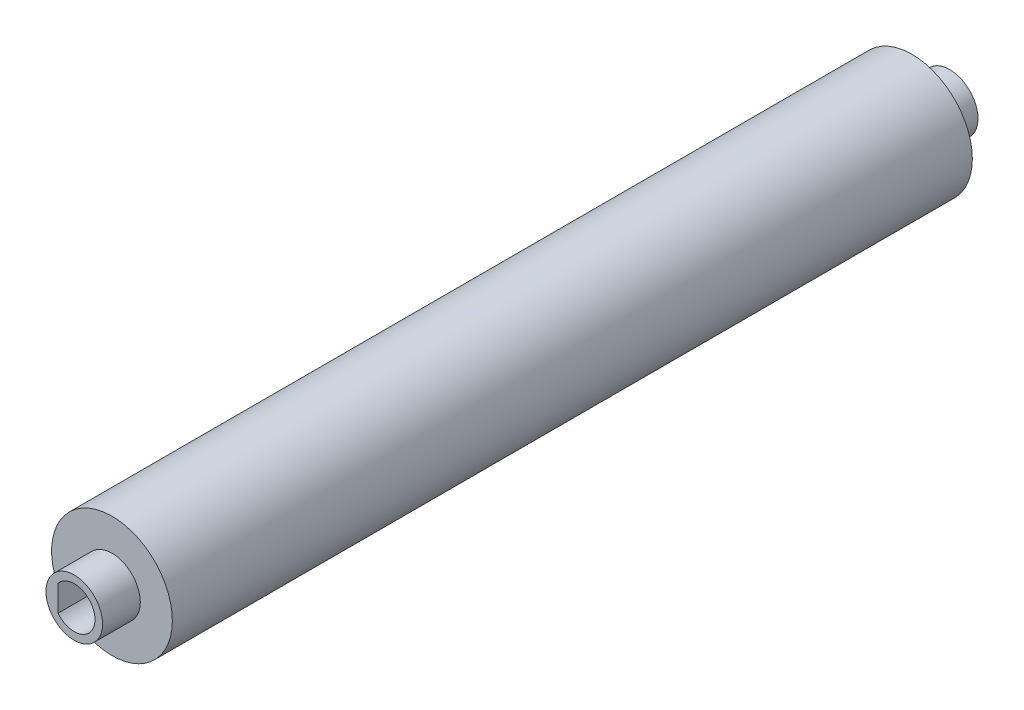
ISO-10303-21;
HEADER;
FILE_DESCRIPTION(('STEP AP214'),'2;1');
FILE_NAME('part.step','',(''),(''),'','','');
FILE_SCHEMA(('AUTOMOTIVE_DESIGN { 1 0 10303 214 1 1 1 1 }'));
ENDSEC;
DATA;
#1=APPLICATION_CONTEXT('core data for automotive mechanical design processes');
#2=APPLICATION_PROTOCOL_DEFINITION('international standard','automotive_design',2000,#1);
#3=PRODUCT_CONTEXT('',#1,'mechanical');
#4=PRODUCT('Part','Part','',(#3));
#5=PRODUCT_RELATED_PRODUCT_CATEGORY('part','',(#4));
#6=PRODUCT_DEFINITION_FORMATION('','',#4);
#7=PRODUCT_DEFINITION_CONTEXT('part definition',#1,'design');
#8=PRODUCT_DEFINITION('design','',#6,#7);
#9=PRODUCT_DEFINITION_SHAPE('','',#8);
#10=(LENGTH_UNIT() NAMED_UNIT(*) SI_UNIT(.MILLI.,.METRE.));
#11=(NAMED_UNIT(*) PLANE_ANGLE_UNIT() SI_UNIT($,.RADIAN.));
#12=(NAMED_UNIT(*) SI_UNIT($,.STERADIAN.) SOLID_ANGLE_UNIT());
#13=UNCERTAINTY_MEASURE_WITH_UNIT(LENGTH_MEASURE(1.E-05),#10,'distance_accuracy_value','');
#14=(GEOMETRIC_REPRESENTATION_CONTEXT(3) GLOBAL_UNCERTAINTY_ASSIGNED_CONTEXT((#13)) GLOBAL_UNIT_ASSIGNED_CONTEXT((#10,
#11,#12)) REPRESENTATION_CONTEXT('',''));
#15=CARTESIAN_POINT('',(0.,0.,0.));
#16=DIRECTION('',(0.,0.,1.));
#17=DIRECTION('',(1.,0.,0.));
#18=AXIS2_PLACEMENT_3D('',#15,#16,#17);
#19=CARTESIAN_POINT('',(0.,0.,106.));
#20=DIRECTION('',(0.,0.,-1.));
#21=DIRECTION('',(-1.,0.,0.));
#22=AXIS2_PLACEMENT_3D('',#19,#20,#21);
#23=CYLINDRICAL_SURFACE('',#22,8.);
#24=CARTESIAN_POINT('',(0.,0.,106.));
#25=DIRECTION('',(0.,0.,1.));
#26=DIRECTION('',(1.,0.,0.));
#27=AXIS2_PLACEMENT_3D('',#24,#25,#26);
#28=CIRCLE('',#27,8.);
#29=CARTESIAN_POINT('',(8.,0.,106.));
#30=VERTEX_POINT('',#29);
#31=EDGE_CURVE('E47',#30,#30,#28,.T.);
#32=ORIENTED_EDGE('',*,*,#31,.F.);
#33=EDGE_LOOP('',(#32));
#34=FACE_BOUND('',#33,.T.);
#35=CARTESIAN_POINT('',(0.,0.,0.));
#36=DIRECTION('',(0.,0.,1.));
#37=DIRECTION('',(1.,0.,0.));
#38=AXIS2_PLACEMENT_3D('',#35,#36,#37);
#39=CIRCLE('',#38,8.);
#40=CARTESIAN_POINT('',(8.,0.,0.));
#41=VERTEX_POINT('',#40);
#42=EDGE_CURVE('E93',#41,#41,#39,.T.);
#43=ORIENTED_EDGE('',*,*,#42,.T.);
#44=EDGE_LOOP('',(#43));
#45=FACE_BOUND('',#44,.T.);
#46=ADVANCED_FACE('F39',(#34,#45),#23,.T.);
#47=CARTESIAN_POINT('',(0.,0.,106.));
#48=DIRECTION('',(0.,0.,1.));
#49=DIRECTION('',(1.,0.,0.));
#50=AXIS2_PLACEMENT_3D('',#47,#48,#49);
#51=PLANE('',#50);
#52=CARTESIAN_POINT('',(0.,0.,106.));
#53=DIRECTION('',(0.,0.,1.));
#54=DIRECTION('',(1.,0.,0.));
#55=AXIS2_PLACEMENT_3D('',#52,#53,#54);
#56=CIRCLE('',#55,3.75);
#57=CARTESIAN_POINT('',(3.75,0.,106.));
#58=VERTEX_POINT('',#57);
#59=EDGE_CURVE('E11',#58,#58,#56,.T.);
#60=ORIENTED_EDGE('',*,*,#59,.F.);
#61=EDGE_LOOP('',(#60));
#62=FACE_BOUND('',#61,.T.);
#63=ORIENTED_EDGE('',*,*,#31,.T.);
#64=EDGE_LOOP('',(#63));
#65=FACE_BOUND('',#64,.T.);
#66=ADVANCED_FACE('F118',(#62,#65),#51,.T.);
#67=CARTESIAN_POINT('',(0.,0.,0.));
#68=DIRECTION('',(0.,0.,1.));
#69=DIRECTION('',(1.,0.,0.));
#70=AXIS2_PLACEMENT_3D('',#67,#68,#69);
#71=PLANE('',#70);
#72=CARTESIAN_POINT('',(0.,0.,0.));
#73=DIRECTION('',(0.,0.,1.));
#74=DIRECTION('',(1.,0.,0.));
#75=AXIS2_PLACEMENT_3D('',#72,#73,#74);
#76=CIRCLE('',#75,3.75);
#77=CARTESIAN_POINT('',(3.75,0.,0.));
#78=VERTEX_POINT('',#77);
#79=EDGE_CURVE('E42',#78,#78,#76,.T.);
#80=ORIENTED_EDGE('',*,*,#79,.T.);
#81=EDGE_LOOP('',(#80));
#82=FACE_BOUND('',#81,.T.);
#83=ORIENTED_EDGE('',*,*,#42,.F.);
#84=EDGE_LOOP('',(#83));
#85=FACE_BOUND('',#84,.T.);
#86=ADVANCED_FACE('F100',(#82,#85),#71,.F.);
#87=CARTESIAN_POINT('',(0.,0.,-5.));
#88=DIRECTION('',(0.,0.,1.));
#89=DIRECTION('',(1.,0.,0.));
#90=AXIS2_PLACEMENT_3D('',#87,#88,#89);
#91=PLANE('',#90);
#92=CARTESIAN_POINT('',(0.,0.,-5.));
#93=DIRECTION('',(0.,0.,1.));
#94=DIRECTION('',(1.,0.,0.));
#95=AXIS2_PLACEMENT_3D('',#92,#93,#94);
#96=CIRCLE('',#95,3.75);
#97=CARTESIAN_POINT('',(3.75,0.,-5.));
#98=VERTEX_POINT('',#97);
#99=EDGE_CURVE('E89',#98,#98,#96,.T.);
#100=ORIENTED_EDGE('',*,*,#99,.F.);
#101=EDGE_LOOP('',(#100));
#102=FACE_BOUND('',#101,.T.);
#103=ADVANCED_FACE('F106',(#102),#91,.F.);
#104=CARTESIAN_POINT('',(0.,0.,-5.));
#105=DIRECTION('',(0.,0.,1.));
#106=DIRECTION('',(1.,0.,0.));
#107=AXIS2_PLACEMENT_3D('',#104,#105,#106);
#108=CYLINDRICAL_SURFACE('',#107,3.75);
#109=ORIENTED_EDGE('',*,*,#99,.T.);
#110=EDGE_LOOP('',(#109));
#111=FACE_BOUND('',#110,.T.);
#112=ORIENTED_EDGE('',*,*,#79,.F.);
#113=EDGE_LOOP('',(#112));
#114=FACE_BOUND('',#113,.T.);
#115=ADVANCED_FACE('F103',(#111,#114),#108,.T.);
#116=ORIENTED_EDGE('',*,*,#59,.T.);
#117=EDGE_LOOP('',(#116));
#118=FACE_BOUND('',#117,.T.);
#119=CARTESIAN_POINT('',(0.,0.,111.));
#120=DIRECTION('',(0.,0.,1.));
#121=DIRECTION('',(1.,0.,0.));
#122=AXIS2_PLACEMENT_3D('',#119,#120,#121);
#123=CIRCLE('',#122,3.75);
#124=CARTESIAN_POINT('',(3.75,0.,111.));
#125=VERTEX_POINT('',#124);
#126=EDGE_CURVE('E71',#125,#125,#123,.T.);
#127=ORIENTED_EDGE('',*,*,#126,.F.);
#128=EDGE_LOOP('',(#127));
#129=FACE_BOUND('',#128,.T.);
#130=ADVANCED_FACE('F105',(#118,#129),#108,.T.);
#131=CARTESIAN_POINT('',(0.,0.,111.));
#132=DIRECTION('',(0.,0.,1.));
#133=DIRECTION('',(1.,0.,0.));
#134=AXIS2_PLACEMENT_3D('',#131,#132,#133);
#135=PLANE('',#134);
#136=CARTESIAN_POINT('',(0.,0.,111.));
#137=DIRECTION('',(0.,0.,1.));
#138=DIRECTION('',(1.,0.,0.));
#139=AXIS2_PLACEMENT_3D('',#136,#137,#138);
#140=CIRCLE('',#139,2.75);
#141=CARTESIAN_POINT('',(-2.15,-1.71464281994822,111.));
#142=VERTEX_POINT('',#141);
#143=CARTESIAN_POINT('',(-2.15,1.71464281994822,111.));
#144=VERTEX_POINT('',#143);
#145=EDGE_CURVE('E55',#142,#144,#140,.T.);
#146=ORIENTED_EDGE('',*,*,#145,.F.);
#147=DIRECTION('',(0.,-1.,0.));
#148=VECTOR('',#147,1.);
#149=CARTESIAN_POINT('',(-2.15,1.71464281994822,111.));
#150=LINE('',#149,#148);
#151=EDGE_CURVE('E75',#144,#142,#150,.T.);
#152=ORIENTED_EDGE('',*,*,#151,.F.);
#153=EDGE_LOOP('',(#146,#152));
#154=FACE_BOUND('',#153,.T.);
#155=ORIENTED_EDGE('',*,*,#126,.T.);
#156=EDGE_LOOP('',(#155));
#157=FACE_BOUND('',#156,.T.);
#158=ADVANCED_FACE('F79',(#154,#157),#135,.T.);
#159=CARTESIAN_POINT('',(0.,0.,90.));
#160=DIRECTION('',(0.,0.,1.));
#161=DIRECTION('',(1.,0.,0.));
#162=AXIS2_PLACEMENT_3D('',#159,#160,#161);
#163=CYLINDRICAL_SURFACE('',#162,2.75);
#164=ORIENTED_EDGE('',*,*,#145,.T.);
#165=DIRECTION('',(0.,0.,1.));
#166=VECTOR('',#165,1.);
#167=CARTESIAN_POINT('',(-2.15,1.71464281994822,90.));
#168=LINE('',#167,#166);
#169=CARTESIAN_POINT('',(-2.15,1.71464281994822,90.));
#170=VERTEX_POINT('',#169);
#171=EDGE_CURVE('E72',#170,#144,#168,.T.);
#172=ORIENTED_EDGE('',*,*,#171,.F.);
#173=CARTESIAN_POINT('',(0.,0.,90.));
#174=DIRECTION('',(0.,0.,1.));
#175=DIRECTION('',(1.,0.,0.));
#176=AXIS2_PLACEMENT_3D('',#173,#174,#175);
#177=CIRCLE('',#176,2.75);
#178=CARTESIAN_POINT('',(-2.15,-1.71464281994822,90.));
#179=VERTEX_POINT('',#178);
#180=EDGE_CURVE('E69',#179,#170,#177,.T.);
#181=ORIENTED_EDGE('',*,*,#180,.F.);
#182=DIRECTION('',(0.,0.,1.));
#183=VECTOR('',#182,1.);
#184=CARTESIAN_POINT('',(-2.15,-1.71464281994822,90.));
#185=LINE('',#184,#183);
#186=EDGE_CURVE('E63',#179,#142,#185,.T.);
#187=ORIENTED_EDGE('',*,*,#186,.T.);
#188=EDGE_LOOP('',(#164,#172,#181,#187));
#189=FACE_BOUND('',#188,.T.);
#190=ADVANCED_FACE('F67',(#189),#163,.F.);
#191=CARTESIAN_POINT('',(-2.15,1.71464281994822,90.));
#192=DIRECTION('',(-1.,0.,0.));
#193=DIRECTION('',(0.,0.,1.));
#194=AXIS2_PLACEMENT_3D('',#191,#192,#193);
#195=PLANE('',#194);
#196=ORIENTED_EDGE('',*,*,#151,.T.);
#197=ORIENTED_EDGE('',*,*,#186,.F.);
#198=DIRECTION('',(0.,-1.,0.));
#199=VECTOR('',#198,1.);
#200=CARTESIAN_POINT('',(-2.15,1.71464281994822,90.));
#201=LINE('',#200,#199);
#202=EDGE_CURVE('E83',#170,#179,#201,.T.);
#203=ORIENTED_EDGE('',*,*,#202,.F.);
#204=ORIENTED_EDGE('',*,*,#171,.T.);
#205=EDGE_LOOP('',(#196,#197,#203,#204));
#206=FACE_BOUND('',#205,.T.);
#207=ADVANCED_FACE('F76',(#206),#195,.F.);
#208=CARTESIAN_POINT('',(0.,0.,90.));
#209=DIRECTION('',(0.,0.,1.));
#210=DIRECTION('',(1.,0.,0.));
#211=AXIS2_PLACEMENT_3D('',#208,#209,#210);
#212=PLANE('',#211);
#213=ORIENTED_EDGE('',*,*,#180,.T.);
#214=ORIENTED_EDGE('',*,*,#202,.T.);
#215=EDGE_LOOP('',(#213,#214));
#216=FACE_BOUND('',#215,.T.);
#217=ADVANCED_FACE('F141',(#216),#212,.T.);
#218=CLOSED_SHELL('',(#46,#66,#86,#103,#115,#130,#158,#190,#207,#217));
#219=MANIFOLD_SOLID_BREP('B2',#218);
#220=ADVANCED_BREP_SHAPE_REPRESENTATION('',(#18,#219),#14);
#221=SHAPE_DEFINITION_REPRESENTATION(#9,#220);
ENDSEC;
END-ISO-10303-21;
